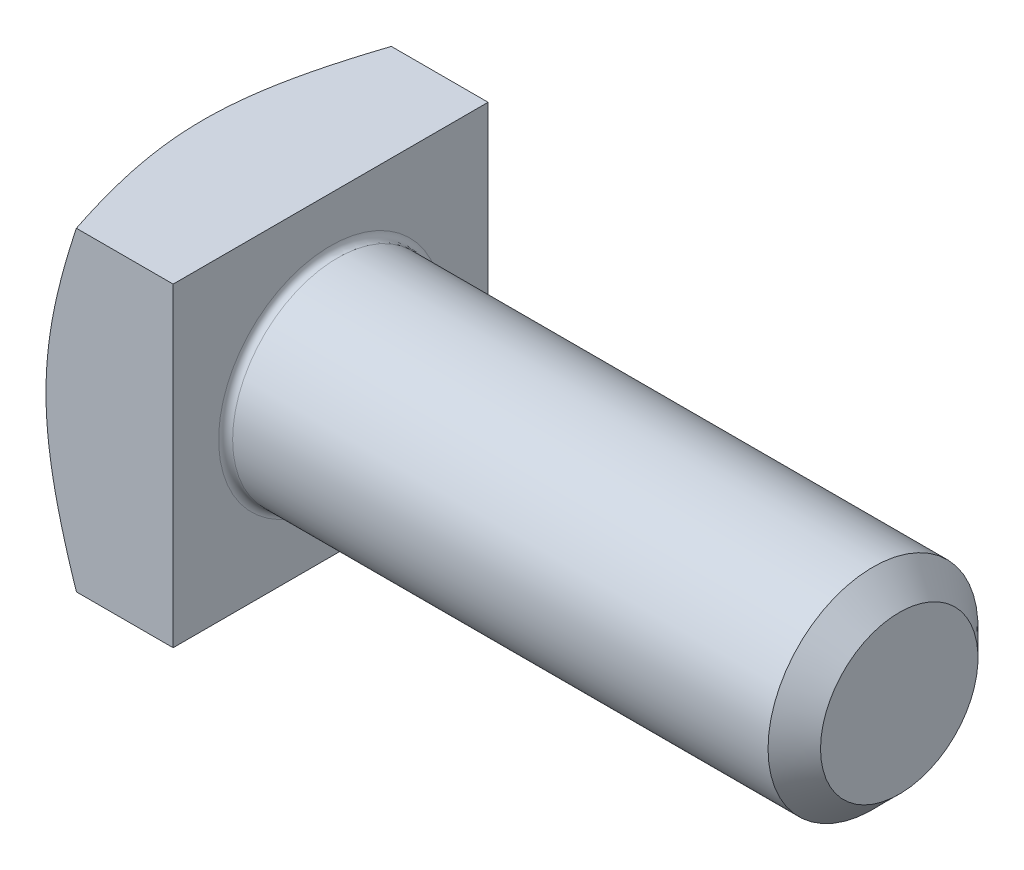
from build123d import *

# Parameters (mm, degrees)
BASEHEADSKE_W  = 36
BASEHEADSKE_H  = 36
BASEHEAD_DEPTH = 15
BODYSKE_W      = 80
BODYSKE_H      = 12
FILLET_2_R     = 0.8


with BuildPart() as part:
    # BaseHeadSke → BaseHead (new body)
    with BuildSketch(Plane(origin=(0, 0, 0), x_dir=(0, 0, -1), z_dir=(1, 0, 0))):
        Rectangle(BASEHEADSKE_W, BASEHEADSKE_H)
    extrude(amount=BASEHEAD_DEPTH)

    # BodySke → BaseBody (revolve)
    with BuildSketch(Plane.XY, mode=Mode.PRIVATE) as basebody_sk:
        with Locations((40, 6)):
            Rectangle(BODYSKE_W, BODYSKE_H)
    revolve(basebody_sk.sketch.rotate(Axis((0, 0, 0), (1, 0, 0)), 90), axis=Axis((0, 0, 0), (1, 0, 0)))

    # ChamferEndSke → ChamferEnd (revolve, cut)
    with BuildSketch(Plane(origin=(0, 0, 0), x_dir=(1, 0, 0), z_dir=(0, 1, 0))):
        Polygon((77, -12), (80, -9), (80, -12), align=None)
    revolve(axis=Axis((0, 0, 0), (1, 0, 0)), mode=Mode.SUBTRACT)

    # HeadChamferSke → HeadChamfer (revolve, cut)
    with BuildSketch(Plane.XY, mode=Mode.PRIVATE) as headchamfer_sk:
        Polygon((15, 49.167603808), (0, 49.167603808), (0, 17), align=None)
    revolve(headchamfer_sk.sketch.rotate(Axis((0, 0, 0), (1, 0, 0)), 314.999990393), axis=Axis((0, 0, 0), (1, 0, 0)), mode=Mode.SUBTRACT)

    # Fillet 2
    fillet_2_edges = [part.edges().sort_by_distance(p)[0] for p in [
        (15, 0, -12),
    ]]
    fillet(fillet_2_edges, radius=FILLET_2_R)


solid = part.part
